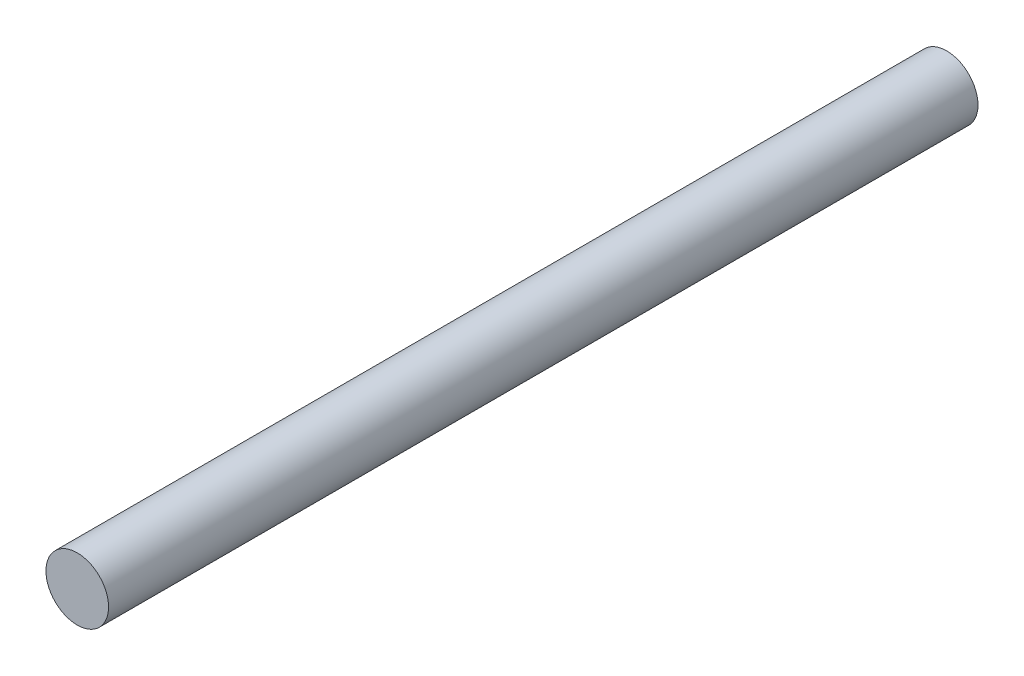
ISO-10303-21;
HEADER;
FILE_DESCRIPTION(('STEP AP214'),'2;1');
FILE_NAME('part.step','',(''),(''),'','','');
FILE_SCHEMA(('AUTOMOTIVE_DESIGN { 1 0 10303 214 1 1 1 1 }'));
ENDSEC;
DATA;
#1=APPLICATION_CONTEXT('core data for automotive mechanical design processes');
#2=APPLICATION_PROTOCOL_DEFINITION('international standard','automotive_design',2000,#1);
#3=PRODUCT_CONTEXT('',#1,'mechanical');
#4=PRODUCT('Part','Part','',(#3));
#5=PRODUCT_RELATED_PRODUCT_CATEGORY('part','',(#4));
#6=PRODUCT_DEFINITION_FORMATION('','',#4);
#7=PRODUCT_DEFINITION_CONTEXT('part definition',#1,'design');
#8=PRODUCT_DEFINITION('design','',#6,#7);
#9=PRODUCT_DEFINITION_SHAPE('','',#8);
#10=(LENGTH_UNIT() NAMED_UNIT(*) SI_UNIT(.MILLI.,.METRE.));
#11=(NAMED_UNIT(*) PLANE_ANGLE_UNIT() SI_UNIT($,.RADIAN.));
#12=(NAMED_UNIT(*) SI_UNIT($,.STERADIAN.) SOLID_ANGLE_UNIT());
#13=UNCERTAINTY_MEASURE_WITH_UNIT(LENGTH_MEASURE(1.E-05),#10,'distance_accuracy_value','');
#14=(GEOMETRIC_REPRESENTATION_CONTEXT(3) GLOBAL_UNCERTAINTY_ASSIGNED_CONTEXT((#13)) GLOBAL_UNIT_ASSIGNED_CONTEXT((#10,
#11,#12)) REPRESENTATION_CONTEXT('',''));
#15=CARTESIAN_POINT('',(0.,0.,0.));
#16=DIRECTION('',(0.,0.,1.));
#17=DIRECTION('',(1.,0.,0.));
#18=AXIS2_PLACEMENT_3D('',#15,#16,#17);
#19=CARTESIAN_POINT('',(0.,0.,250.));
#20=DIRECTION('',(0.,0.,-1.));
#21=DIRECTION('',(-1.,0.,0.));
#22=AXIS2_PLACEMENT_3D('',#19,#20,#21);
#23=CYLINDRICAL_SURFACE('',#22,9.);
#24=CARTESIAN_POINT('',(0.,0.,250.));
#25=DIRECTION('',(0.,0.,1.));
#26=DIRECTION('',(1.,0.,0.));
#27=AXIS2_PLACEMENT_3D('',#24,#25,#26);
#28=CIRCLE('',#27,9.);
#29=CARTESIAN_POINT('',(9.,0.,250.));
#30=VERTEX_POINT('',#29);
#31=EDGE_CURVE('E10',#30,#30,#28,.T.);
#32=ORIENTED_EDGE('',*,*,#31,.F.);
#33=EDGE_LOOP('',(#32));
#34=FACE_BOUND('',#33,.T.);
#35=CARTESIAN_POINT('',(0.,0.,0.));
#36=DIRECTION('',(0.,0.,1.));
#37=DIRECTION('',(1.,0.,0.));
#38=AXIS2_PLACEMENT_3D('',#35,#36,#37);
#39=CIRCLE('',#38,9.);
#40=CARTESIAN_POINT('',(9.,0.,0.));
#41=VERTEX_POINT('',#40);
#42=EDGE_CURVE('E42',#41,#41,#39,.T.);
#43=ORIENTED_EDGE('',*,*,#42,.T.);
#44=EDGE_LOOP('',(#43));
#45=FACE_BOUND('',#44,.T.);
#46=ADVANCED_FACE('F39',(#34,#45),#23,.T.);
#47=CARTESIAN_POINT('',(0.,0.,250.));
#48=DIRECTION('',(0.,0.,1.));
#49=DIRECTION('',(1.,0.,0.));
#50=AXIS2_PLACEMENT_3D('',#47,#48,#49);
#51=PLANE('',#50);
#52=ORIENTED_EDGE('',*,*,#31,.T.);
#53=EDGE_LOOP('',(#52));
#54=FACE_BOUND('',#53,.T.);
#55=ADVANCED_FACE('F54',(#54),#51,.T.);
#56=CARTESIAN_POINT('',(0.,0.,0.));
#57=DIRECTION('',(0.,0.,1.));
#58=DIRECTION('',(1.,0.,0.));
#59=AXIS2_PLACEMENT_3D('',#56,#57,#58);
#60=PLANE('',#59);
#61=ORIENTED_EDGE('',*,*,#42,.F.);
#62=EDGE_LOOP('',(#61));
#63=FACE_BOUND('',#62,.T.);
#64=ADVANCED_FACE('F52',(#63),#60,.F.);
#65=CLOSED_SHELL('',(#46,#55,#64));
#66=MANIFOLD_SOLID_BREP('B2',#65);
#67=ADVANCED_BREP_SHAPE_REPRESENTATION('',(#18,#66),#14);
#68=SHAPE_DEFINITION_REPRESENTATION(#9,#67);
ENDSEC;
END-ISO-10303-21;
